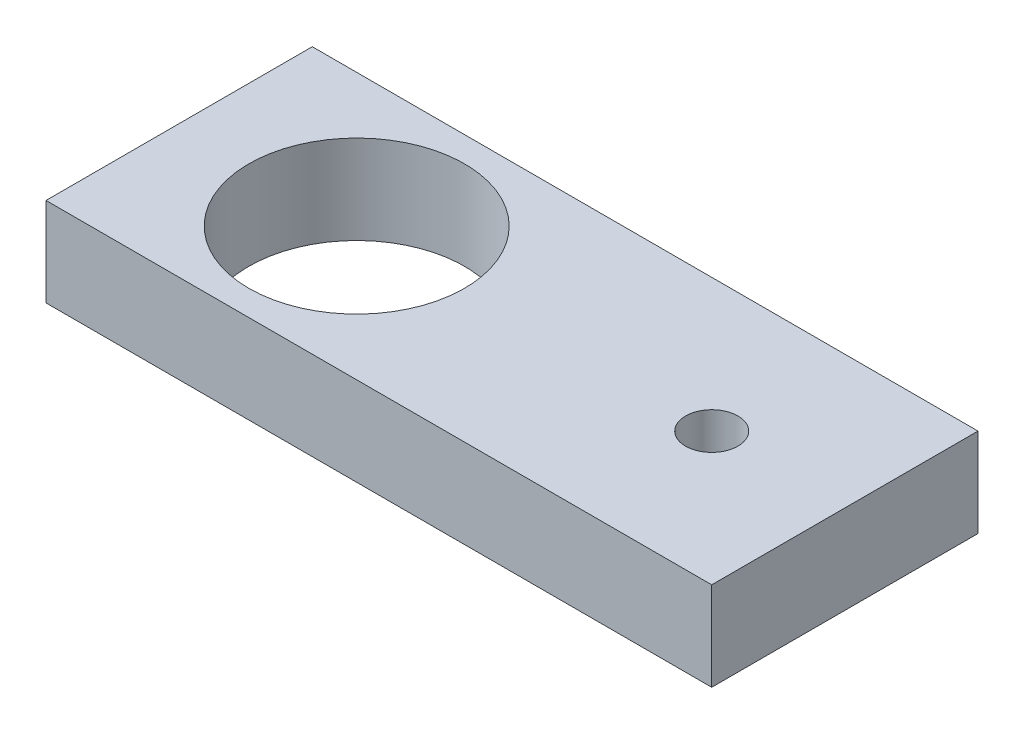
from build123d import *

# Parameters (mm, degrees)
SKETCH2_W           = 15
SKETCH2_H           = 6
BOSS_EXTRUDE1_DEPTH = 2
SKETCH3_R           = 2.43
SKETCH3_R_2         = 0.590071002
CUT_EXTRUDE2_DEPTH  = 17.278820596


with BuildPart() as part:
    # Sketch2 → Boss-Extrude1 (new body)
    with BuildSketch(Plane(origin=(0, 0, 0), x_dir=(1, 0, 0), z_dir=(0, 1, 0))):
        with Locations((7.5, -3)):
            Rectangle(SKETCH2_W, SKETCH2_H)
    extrude(amount=BOSS_EXTRUDE1_DEPTH)

    # Sketch3 → Cut-Extrude2 (cut, through all)
    with BuildSketch(Plane(origin=(0, 2, 0), x_dir=(1, 0, 0), z_dir=(0, 1, 0))):
        with Locations(Location((4.000000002, -2.999998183, 0), (0, 0, 270))):
            Circle(SKETCH3_R)
        with Locations(Location((12, -2.999842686, 0), (0, 0, 270))):
            Circle(SKETCH3_R_2)
    extrude(amount=-CUT_EXTRUDE2_DEPTH, mode=Mode.SUBTRACT)


solid = part.part
